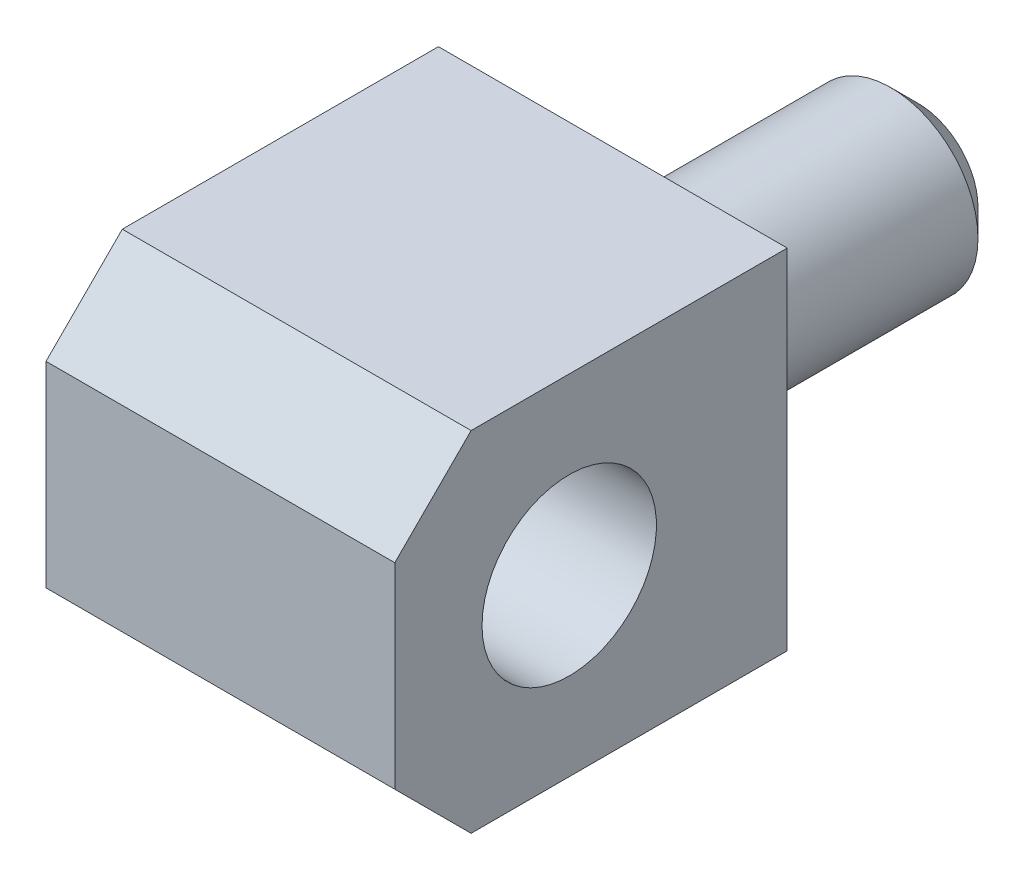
ISO-10303-21;
HEADER;
FILE_DESCRIPTION(('STEP AP214'),'2;1');
FILE_NAME('part.step','',(''),(''),'','','');
FILE_SCHEMA(('AUTOMOTIVE_DESIGN { 1 0 10303 214 1 1 1 1 }'));
ENDSEC;
DATA;
#1=APPLICATION_CONTEXT('core data for automotive mechanical design processes');
#2=APPLICATION_PROTOCOL_DEFINITION('international standard','automotive_design',2000,#1);
#3=PRODUCT_CONTEXT('',#1,'mechanical');
#4=PRODUCT('Part','Part','',(#3));
#5=PRODUCT_RELATED_PRODUCT_CATEGORY('part','',(#4));
#6=PRODUCT_DEFINITION_FORMATION('','',#4);
#7=PRODUCT_DEFINITION_CONTEXT('part definition',#1,'design');
#8=PRODUCT_DEFINITION('design','',#6,#7);
#9=PRODUCT_DEFINITION_SHAPE('','',#8);
#10=(LENGTH_UNIT() NAMED_UNIT(*) SI_UNIT(.MILLI.,.METRE.));
#11=(NAMED_UNIT(*) PLANE_ANGLE_UNIT() SI_UNIT($,.RADIAN.));
#12=(NAMED_UNIT(*) SI_UNIT($,.STERADIAN.) SOLID_ANGLE_UNIT());
#13=UNCERTAINTY_MEASURE_WITH_UNIT(LENGTH_MEASURE(1.E-05),#10,'distance_accuracy_value','');
#14=(GEOMETRIC_REPRESENTATION_CONTEXT(3) GLOBAL_UNCERTAINTY_ASSIGNED_CONTEXT((#13)) GLOBAL_UNIT_ASSIGNED_CONTEXT((#10,
#11,#12)) REPRESENTATION_CONTEXT('',''));
#15=CARTESIAN_POINT('',(0.,0.,0.));
#16=DIRECTION('',(0.,0.,1.));
#17=DIRECTION('',(1.,0.,0.));
#18=AXIS2_PLACEMENT_3D('',#15,#16,#17);
#19=CARTESIAN_POINT('',(8.,8.,0.));
#20=DIRECTION('',(0.,0.,-1.));
#21=DIRECTION('',(1.,0.,0.));
#22=AXIS2_PLACEMENT_3D('',#19,#20,#21);
#23=PLANE('',#22);
#24=CARTESIAN_POINT('',(0.,0.,0.));
#25=DIRECTION('',(0.,0.,-1.));
#26=DIRECTION('',(1.,0.,0.));
#27=AXIS2_PLACEMENT_3D('',#24,#25,#26);
#28=CIRCLE('',#27,4.);
#29=CARTESIAN_POINT('',(4.,0.,0.));
#30=VERTEX_POINT('',#29);
#31=EDGE_CURVE('E100',#30,#30,#28,.T.);
#32=ORIENTED_EDGE('',*,*,#31,.F.);
#33=EDGE_LOOP('',(#32));
#34=FACE_BOUND('',#33,.T.);
#35=DIRECTION('',(-1.,0.,0.));
#36=VECTOR('',#35,1.);
#37=CARTESIAN_POINT('',(8.,8.,0.));
#38=LINE('',#37,#36);
#39=CARTESIAN_POINT('',(8.,8.,0.));
#40=VERTEX_POINT('',#39);
#41=CARTESIAN_POINT('',(-8.,8.,0.));
#42=VERTEX_POINT('',#41);
#43=EDGE_CURVE('E89',#40,#42,#38,.T.);
#44=ORIENTED_EDGE('',*,*,#43,.F.);
#45=DIRECTION('',(0.,-1.,0.));
#46=VECTOR('',#45,1.);
#47=CARTESIAN_POINT('',(8.,8.,0.));
#48=LINE('',#47,#46);
#49=CARTESIAN_POINT('',(8.,-8.,0.));
#50=VERTEX_POINT('',#49);
#51=EDGE_CURVE('E88',#40,#50,#48,.T.);
#52=ORIENTED_EDGE('',*,*,#51,.T.);
#53=DIRECTION('',(-1.,0.,0.));
#54=VECTOR('',#53,1.);
#55=CARTESIAN_POINT('',(8.,-8.,0.));
#56=LINE('',#55,#54);
#57=CARTESIAN_POINT('',(-8.,-8.,0.));
#58=VERTEX_POINT('',#57);
#59=EDGE_CURVE('E75',#50,#58,#56,.T.);
#60=ORIENTED_EDGE('',*,*,#59,.T.);
#61=DIRECTION('',(0.,-1.,0.));
#62=VECTOR('',#61,1.);
#63=CARTESIAN_POINT('',(-8.,8.,0.));
#64=LINE('',#63,#62);
#65=EDGE_CURVE('E82',#42,#58,#64,.T.);
#66=ORIENTED_EDGE('',*,*,#65,.F.);
#67=EDGE_LOOP('',(#44,#52,#60,#66));
#68=FACE_BOUND('',#67,.T.);
#69=ADVANCED_FACE('F14',(#34,#68),#23,.T.);
#70=CARTESIAN_POINT('',(8.,8.,0.));
#71=DIRECTION('',(0.,-1.,0.));
#72=DIRECTION('',(1.,0.,0.));
#73=AXIS2_PLACEMENT_3D('',#70,#71,#72);
#74=PLANE('',#73);
#75=DIRECTION('',(0.,0.,1.));
#76=VECTOR('',#75,1.);
#77=CARTESIAN_POINT('',(-8.,8.,0.));
#78=LINE('',#77,#76);
#79=CARTESIAN_POINT('',(-8.,8.,14.5));
#80=VERTEX_POINT('',#79);
#81=EDGE_CURVE('E93',#42,#80,#78,.T.);
#82=ORIENTED_EDGE('',*,*,#81,.T.);
#83=DIRECTION('',(1.,0.,0.));
#84=VECTOR('',#83,1.);
#85=CARTESIAN_POINT('',(8.,8.,14.5));
#86=LINE('',#85,#84);
#87=CARTESIAN_POINT('',(8.,8.,14.5));
#88=VERTEX_POINT('',#87);
#89=EDGE_CURVE('E29',#80,#88,#86,.T.);
#90=ORIENTED_EDGE('',*,*,#89,.T.);
#91=DIRECTION('',(0.,0.,1.));
#92=VECTOR('',#91,1.);
#93=CARTESIAN_POINT('',(8.,8.,0.));
#94=LINE('',#93,#92);
#95=EDGE_CURVE('E90',#40,#88,#94,.T.);
#96=ORIENTED_EDGE('',*,*,#95,.F.);
#97=ORIENTED_EDGE('',*,*,#43,.T.);
#98=EDGE_LOOP('',(#82,#90,#96,#97));
#99=FACE_BOUND('',#98,.T.);
#100=ADVANCED_FACE('F134',(#99),#74,.F.);
#101=CARTESIAN_POINT('',(8.,-8.,18.));
#102=DIRECTION('',(0.,0.,1.));
#103=DIRECTION('',(0.,-1.,0.));
#104=AXIS2_PLACEMENT_3D('',#101,#102,#103);
#105=PLANE('',#104);
#106=DIRECTION('',(0.,1.,0.));
#107=VECTOR('',#106,1.);
#108=CARTESIAN_POINT('',(-8.,-8.,18.));
#109=LINE('',#108,#107);
#110=CARTESIAN_POINT('',(-8.,-4.5,18.));
#111=VERTEX_POINT('',#110);
#112=CARTESIAN_POINT('',(-8.,4.49999999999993,18.));
#113=VERTEX_POINT('',#112);
#114=EDGE_CURVE('E81',#111,#113,#109,.T.);
#115=ORIENTED_EDGE('',*,*,#114,.F.);
#116=DIRECTION('',(1.,0.,0.));
#117=VECTOR('',#116,1.);
#118=CARTESIAN_POINT('',(8.,-4.5,18.));
#119=LINE('',#118,#117);
#120=CARTESIAN_POINT('',(8.,-4.5,18.));
#121=VERTEX_POINT('',#120);
#122=EDGE_CURVE('E120',#111,#121,#119,.T.);
#123=ORIENTED_EDGE('',*,*,#122,.T.);
#124=DIRECTION('',(0.,1.,0.));
#125=VECTOR('',#124,1.);
#126=CARTESIAN_POINT('',(8.,-8.,18.));
#127=LINE('',#126,#125);
#128=CARTESIAN_POINT('',(8.,4.49999999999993,18.));
#129=VERTEX_POINT('',#128);
#130=EDGE_CURVE('E108',#121,#129,#127,.T.);
#131=ORIENTED_EDGE('',*,*,#130,.T.);
#132=DIRECTION('',(-1.,0.,0.));
#133=VECTOR('',#132,1.);
#134=CARTESIAN_POINT('',(-8.,4.49999999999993,18.));
#135=LINE('',#134,#133);
#136=EDGE_CURVE('E117',#129,#113,#135,.T.);
#137=ORIENTED_EDGE('',*,*,#136,.T.);
#138=EDGE_LOOP('',(#115,#123,#131,#137));
#139=FACE_BOUND('',#138,.T.);
#140=ADVANCED_FACE('F141',(#139),#105,.T.);
#141=CARTESIAN_POINT('',(8.,-8.,18.));
#142=DIRECTION('',(0.,1.,0.));
#143=DIRECTION('',(0.,0.,1.));
#144=AXIS2_PLACEMENT_3D('',#141,#142,#143);
#145=PLANE('',#144);
#146=DIRECTION('',(0.,0.,-1.));
#147=VECTOR('',#146,1.);
#148=CARTESIAN_POINT('',(8.,-8.,18.));
#149=LINE('',#148,#147);
#150=CARTESIAN_POINT('',(8.,-8.,14.5));
#151=VERTEX_POINT('',#150);
#152=EDGE_CURVE('E106',#151,#50,#149,.T.);
#153=ORIENTED_EDGE('',*,*,#152,.F.);
#154=DIRECTION('',(-1.,0.,0.));
#155=VECTOR('',#154,1.);
#156=CARTESIAN_POINT('',(-8.,-8.,14.5));
#157=LINE('',#156,#155);
#158=CARTESIAN_POINT('',(-8.,-8.,14.5));
#159=VERTEX_POINT('',#158);
#160=EDGE_CURVE('E78',#151,#159,#157,.T.);
#161=ORIENTED_EDGE('',*,*,#160,.T.);
#162=DIRECTION('',(0.,0.,-1.));
#163=VECTOR('',#162,1.);
#164=CARTESIAN_POINT('',(-8.,-8.,18.));
#165=LINE('',#164,#163);
#166=EDGE_CURVE('E71',#159,#58,#165,.T.);
#167=ORIENTED_EDGE('',*,*,#166,.T.);
#168=ORIENTED_EDGE('',*,*,#59,.F.);
#169=EDGE_LOOP('',(#153,#161,#167,#168));
#170=FACE_BOUND('',#169,.T.);
#171=ADVANCED_FACE('F74',(#170),#145,.F.);
#172=CARTESIAN_POINT('',(8.,8.,0.));
#173=DIRECTION('',(-1.,0.,0.));
#174=DIRECTION('',(0.,0.,-1.));
#175=AXIS2_PLACEMENT_3D('',#172,#173,#174);
#176=PLANE('',#175);
#177=CARTESIAN_POINT('',(8.,0.,10.));
#178=DIRECTION('',(1.,0.,0.));
#179=DIRECTION('',(0.,0.,1.));
#180=AXIS2_PLACEMENT_3D('',#177,#178,#179);
#181=CIRCLE('',#180,4.);
#182=CARTESIAN_POINT('',(8.,0.,14.));
#183=VERTEX_POINT('',#182);
#184=EDGE_CURVE('E97',#183,#183,#181,.T.);
#185=ORIENTED_EDGE('',*,*,#184,.F.);
#186=EDGE_LOOP('',(#185));
#187=FACE_BOUND('',#186,.T.);
#188=ORIENTED_EDGE('',*,*,#130,.F.);
#189=DIRECTION('',(0.,-0.707106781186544,-0.707106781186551));
#190=VECTOR('',#189,1.);
#191=CARTESIAN_POINT('',(8.,-8.,14.5));
#192=LINE('',#191,#190);
#193=EDGE_CURVE('E123',#121,#151,#192,.T.);
#194=ORIENTED_EDGE('',*,*,#193,.T.);
#195=ORIENTED_EDGE('',*,*,#152,.T.);
#196=ORIENTED_EDGE('',*,*,#51,.F.);
#197=ORIENTED_EDGE('',*,*,#95,.T.);
#198=DIRECTION('',(0.,-0.707106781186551,0.707106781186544));
#199=VECTOR('',#198,1.);
#200=CARTESIAN_POINT('',(8.,4.49999999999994,18.));
#201=LINE('',#200,#199);
#202=EDGE_CURVE('E36',#88,#129,#201,.T.);
#203=ORIENTED_EDGE('',*,*,#202,.T.);
#204=EDGE_LOOP('',(#188,#194,#195,#196,#197,#203));
#205=FACE_BOUND('',#204,.T.);
#206=ADVANCED_FACE('F144',(#187,#205),#176,.F.);
#207=CARTESIAN_POINT('',(-8.,8.,0.));
#208=DIRECTION('',(-1.,0.,0.));
#209=DIRECTION('',(0.,0.,-1.));
#210=AXIS2_PLACEMENT_3D('',#207,#208,#209);
#211=PLANE('',#210);
#212=ORIENTED_EDGE('',*,*,#166,.F.);
#213=DIRECTION('',(0.,0.707106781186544,0.707106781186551));
#214=VECTOR('',#213,1.);
#215=CARTESIAN_POINT('',(-8.,-7.25,15.25));
#216=LINE('',#215,#214);
#217=EDGE_CURVE('E115',#159,#111,#216,.T.);
#218=ORIENTED_EDGE('',*,*,#217,.T.);
#219=ORIENTED_EDGE('',*,*,#114,.T.);
#220=DIRECTION('',(0.,0.707106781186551,-0.707106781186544));
#221=VECTOR('',#220,1.);
#222=CARTESIAN_POINT('',(-8.,15.25,7.25));
#223=LINE('',#222,#221);
#224=EDGE_CURVE('E113',#113,#80,#223,.T.);
#225=ORIENTED_EDGE('',*,*,#224,.T.);
#226=ORIENTED_EDGE('',*,*,#81,.F.);
#227=ORIENTED_EDGE('',*,*,#65,.T.);
#228=EDGE_LOOP('',(#212,#218,#219,#225,#226,#227));
#229=FACE_BOUND('',#228,.T.);
#230=ADVANCED_FACE('F92',(#229),#211,.T.);
#231=CARTESIAN_POINT('',(8.,-8.,14.5));
#232=DIRECTION('',(0.,-0.707106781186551,0.707106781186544));
#233=DIRECTION('',(0.,-0.707106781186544,-0.707106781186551));
#234=AXIS2_PLACEMENT_3D('',#231,#232,#233);
#235=PLANE('',#234);
#236=ORIENTED_EDGE('',*,*,#193,.F.);
#237=ORIENTED_EDGE('',*,*,#122,.F.);
#238=ORIENTED_EDGE('',*,*,#217,.F.);
#239=ORIENTED_EDGE('',*,*,#160,.F.);
#240=EDGE_LOOP('',(#236,#237,#238,#239));
#241=FACE_BOUND('',#240,.T.);
#242=ADVANCED_FACE('F160',(#241),#235,.T.);
#243=CARTESIAN_POINT('',(8.,4.49999999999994,18.));
#244=DIRECTION('',(0.,0.707106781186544,0.707106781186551));
#245=DIRECTION('',(0.,-0.707106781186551,0.707106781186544));
#246=AXIS2_PLACEMENT_3D('',#243,#244,#245);
#247=PLANE('',#246);
#248=ORIENTED_EDGE('',*,*,#202,.F.);
#249=ORIENTED_EDGE('',*,*,#89,.F.);
#250=ORIENTED_EDGE('',*,*,#224,.F.);
#251=ORIENTED_EDGE('',*,*,#136,.F.);
#252=EDGE_LOOP('',(#248,#249,#250,#251));
#253=FACE_BOUND('',#252,.T.);
#254=ADVANCED_FACE('F168',(#253),#247,.T.);
#255=CARTESIAN_POINT('',(0.,0.,-14.));
#256=DIRECTION('',(0.,0.,1.));
#257=DIRECTION('',(-1.,0.,0.));
#258=AXIS2_PLACEMENT_3D('',#255,#256,#257);
#259=CYLINDRICAL_SURFACE('',#258,4.);
#260=CARTESIAN_POINT('',(0.,0.,-12.75));
#261=DIRECTION('',(0.,0.,-1.));
#262=DIRECTION('',(1.,0.,0.));
#263=AXIS2_PLACEMENT_3D('',#260,#261,#262);
#264=CIRCLE('',#263,4.);
#265=CARTESIAN_POINT('',(4.,0.,-12.75));
#266=VERTEX_POINT('',#265);
#267=EDGE_CURVE('E9',#266,#266,#264,.F.);
#268=ORIENTED_EDGE('',*,*,#267,.T.);
#269=EDGE_LOOP('',(#268));
#270=FACE_BOUND('',#269,.T.);
#271=ORIENTED_EDGE('',*,*,#31,.T.);
#272=EDGE_LOOP('',(#271));
#273=FACE_BOUND('',#272,.T.);
#274=ADVANCED_FACE('F131',(#270,#273),#259,.T.);
#275=CARTESIAN_POINT('',(0.,0.,-14.));
#276=DIRECTION('',(0.,0.,-1.));
#277=DIRECTION('',(1.,0.,0.));
#278=AXIS2_PLACEMENT_3D('',#275,#276,#277);
#279=PLANE('',#278);
#280=CARTESIAN_POINT('',(0.,0.,-14.));
#281=DIRECTION('',(0.,0.,-1.));
#282=DIRECTION('',(1.,0.,0.));
#283=AXIS2_PLACEMENT_3D('',#280,#281,#282);
#284=CIRCLE('',#283,2.75);
#285=CARTESIAN_POINT('',(2.75,0.,-14.));
#286=VERTEX_POINT('',#285);
#287=EDGE_CURVE('E22',#286,#286,#284,.T.);
#288=ORIENTED_EDGE('',*,*,#287,.T.);
#289=EDGE_LOOP('',(#288));
#290=FACE_BOUND('',#289,.T.);
#291=ADVANCED_FACE('F171',(#290),#279,.T.);
#292=CARTESIAN_POINT('',(-4.,0.,10.));
#293=DIRECTION('',(1.,0.,0.));
#294=DIRECTION('',(0.,0.,1.));
#295=AXIS2_PLACEMENT_3D('',#292,#293,#294);
#296=CYLINDRICAL_SURFACE('',#295,4.);
#297=CARTESIAN_POINT('',(-4.,0.,10.));
#298=DIRECTION('',(1.,0.,0.));
#299=DIRECTION('',(0.,0.,1.));
#300=AXIS2_PLACEMENT_3D('',#297,#298,#299);
#301=CIRCLE('',#300,4.);
#302=CARTESIAN_POINT('',(-4.,0.,14.));
#303=VERTEX_POINT('',#302);
#304=EDGE_CURVE('E94',#303,#303,#301,.T.);
#305=ORIENTED_EDGE('',*,*,#304,.F.);
#306=EDGE_LOOP('',(#305));
#307=FACE_BOUND('',#306,.T.);
#308=ORIENTED_EDGE('',*,*,#184,.T.);
#309=EDGE_LOOP('',(#308));
#310=FACE_BOUND('',#309,.T.);
#311=ADVANCED_FACE('F182',(#307,#310),#296,.F.);
#312=CARTESIAN_POINT('',(-4.,0.,10.));
#313=DIRECTION('',(1.,0.,0.));
#314=DIRECTION('',(0.,0.,1.));
#315=AXIS2_PLACEMENT_3D('',#312,#313,#314);
#316=PLANE('',#315);
#317=ORIENTED_EDGE('',*,*,#304,.T.);
#318=EDGE_LOOP('',(#317));
#319=FACE_BOUND('',#318,.T.);
#320=ADVANCED_FACE('F179',(#319),#316,.T.);
#321=CARTESIAN_POINT('',(0.,0.,-14.));
#322=DIRECTION('',(0.,0.,1.));
#323=DIRECTION('',(-1.,0.,0.));
#324=AXIS2_PLACEMENT_3D('',#321,#322,#323);
#325=CONICAL_SURFACE('',#324,2.75,0.785398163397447);
#326=ORIENTED_EDGE('',*,*,#267,.F.);
#327=EDGE_LOOP('',(#326));
#328=FACE_BOUND('',#327,.T.);
#329=ORIENTED_EDGE('',*,*,#287,.F.);
#330=EDGE_LOOP('',(#329));
#331=FACE_BOUND('',#330,.T.);
#332=ADVANCED_FACE('F16',(#328,#331),#325,.T.);
#333=CLOSED_SHELL('',(#69,#100,#140,#171,#206,#230,#242,#254,#274,#291,#311,#320,#332));
#334=MANIFOLD_SOLID_BREP('B1',#333);
#335=ADVANCED_BREP_SHAPE_REPRESENTATION('',(#18,#334),#14);
#336=SHAPE_DEFINITION_REPRESENTATION(#9,#335);
ENDSEC;
END-ISO-10303-21;
